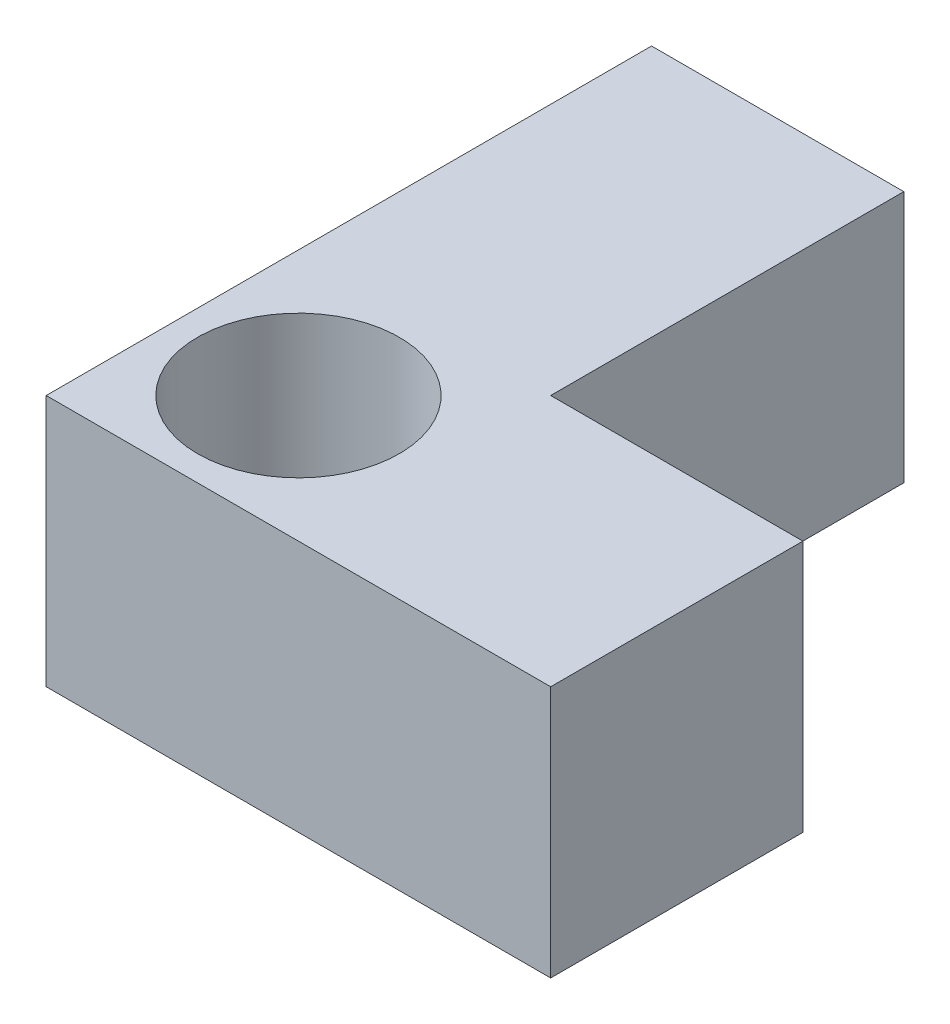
ISO-10303-21;
HEADER;
FILE_DESCRIPTION(('STEP AP214'),'2;1');
FILE_NAME('part.step','',(''),(''),'','','');
FILE_SCHEMA(('AUTOMOTIVE_DESIGN { 1 0 10303 214 1 1 1 1 }'));
ENDSEC;
DATA;
#1=APPLICATION_CONTEXT('core data for automotive mechanical design processes');
#2=APPLICATION_PROTOCOL_DEFINITION('international standard','automotive_design',2000,#1);
#3=PRODUCT_CONTEXT('',#1,'mechanical');
#4=PRODUCT('Part','Part','',(#3));
#5=PRODUCT_RELATED_PRODUCT_CATEGORY('part','',(#4));
#6=PRODUCT_DEFINITION_FORMATION('','',#4);
#7=PRODUCT_DEFINITION_CONTEXT('part definition',#1,'design');
#8=PRODUCT_DEFINITION('design','',#6,#7);
#9=PRODUCT_DEFINITION_SHAPE('','',#8);
#10=(LENGTH_UNIT() NAMED_UNIT(*) SI_UNIT(.MILLI.,.METRE.));
#11=(NAMED_UNIT(*) PLANE_ANGLE_UNIT() SI_UNIT($,.RADIAN.));
#12=(NAMED_UNIT(*) SI_UNIT($,.STERADIAN.) SOLID_ANGLE_UNIT());
#13=UNCERTAINTY_MEASURE_WITH_UNIT(LENGTH_MEASURE(1.E-05),#10,'distance_accuracy_value','');
#14=(GEOMETRIC_REPRESENTATION_CONTEXT(3) GLOBAL_UNCERTAINTY_ASSIGNED_CONTEXT((#13)) GLOBAL_UNIT_ASSIGNED_CONTEXT((#10,
#11,#12)) REPRESENTATION_CONTEXT('',''));
#15=CARTESIAN_POINT('',(0.,0.,0.));
#16=DIRECTION('',(0.,0.,1.));
#17=DIRECTION('',(1.,0.,0.));
#18=AXIS2_PLACEMENT_3D('',#15,#16,#17);
#19=CARTESIAN_POINT('',(100.,50.,0.));
#20=DIRECTION('',(0.,0.,-1.));
#21=DIRECTION('',(-1.,0.,0.));
#22=AXIS2_PLACEMENT_3D('',#19,#20,#21);
#23=PLANE('',#22);
#24=DIRECTION('',(1.,0.,0.));
#25=VECTOR('',#24,1.);
#26=CARTESIAN_POINT('',(100.,0.,0.));
#27=LINE('',#26,#25);
#28=CARTESIAN_POINT('',(0.,0.,0.));
#29=VERTEX_POINT('',#28);
#30=CARTESIAN_POINT('',(100.,0.,0.));
#31=VERTEX_POINT('',#30);
#32=EDGE_CURVE('E119',#29,#31,#27,.T.);
#33=ORIENTED_EDGE('',*,*,#32,.T.);
#34=DIRECTION('',(0.,-1.,0.));
#35=VECTOR('',#34,1.);
#36=CARTESIAN_POINT('',(100.,50.,0.));
#37=LINE('',#36,#35);
#38=CARTESIAN_POINT('',(100.,50.,0.));
#39=VERTEX_POINT('',#38);
#40=EDGE_CURVE('E11',#39,#31,#37,.T.);
#41=ORIENTED_EDGE('',*,*,#40,.F.);
#42=DIRECTION('',(1.,0.,0.));
#43=VECTOR('',#42,1.);
#44=CARTESIAN_POINT('',(100.,50.,0.));
#45=LINE('',#44,#43);
#46=CARTESIAN_POINT('',(0.,50.,0.));
#47=VERTEX_POINT('',#46);
#48=EDGE_CURVE('E130',#47,#39,#45,.T.);
#49=ORIENTED_EDGE('',*,*,#48,.F.);
#50=DIRECTION('',(0.,-1.,0.));
#51=VECTOR('',#50,1.);
#52=CARTESIAN_POINT('',(0.,50.,0.));
#53=LINE('',#52,#51);
#54=EDGE_CURVE('E115',#47,#29,#53,.T.);
#55=ORIENTED_EDGE('',*,*,#54,.T.);
#56=EDGE_LOOP('',(#33,#41,#49,#55));
#57=FACE_BOUND('',#56,.T.);
#58=ADVANCED_FACE('F35',(#57),#23,.F.);
#59=CARTESIAN_POINT('',(100.,50.,-50.));
#60=DIRECTION('',(-1.,0.,0.));
#61=DIRECTION('',(0.,0.,1.));
#62=AXIS2_PLACEMENT_3D('',#59,#60,#61);
#63=PLANE('',#62);
#64=DIRECTION('',(0.,0.,-1.));
#65=VECTOR('',#64,1.);
#66=CARTESIAN_POINT('',(100.,0.,-50.));
#67=LINE('',#66,#65);
#68=CARTESIAN_POINT('',(100.,0.,-50.));
#69=VERTEX_POINT('',#68);
#70=EDGE_CURVE('E122',#31,#69,#67,.T.);
#71=ORIENTED_EDGE('',*,*,#70,.T.);
#72=DIRECTION('',(0.,-1.,0.));
#73=VECTOR('',#72,1.);
#74=CARTESIAN_POINT('',(100.,50.,-50.));
#75=LINE('',#74,#73);
#76=CARTESIAN_POINT('',(100.,50.,-50.));
#77=VERTEX_POINT('',#76);
#78=EDGE_CURVE('E43',#77,#69,#75,.T.);
#79=ORIENTED_EDGE('',*,*,#78,.F.);
#80=DIRECTION('',(0.,0.,-1.));
#81=VECTOR('',#80,1.);
#82=CARTESIAN_POINT('',(100.,50.,-50.));
#83=LINE('',#82,#81);
#84=EDGE_CURVE('E88',#39,#77,#83,.T.);
#85=ORIENTED_EDGE('',*,*,#84,.F.);
#86=ORIENTED_EDGE('',*,*,#40,.T.);
#87=EDGE_LOOP('',(#71,#79,#85,#86));
#88=FACE_BOUND('',#87,.T.);
#89=ADVANCED_FACE('F155',(#88),#63,.F.);
#90=CARTESIAN_POINT('',(50.,50.,-50.));
#91=DIRECTION('',(0.,0.,1.));
#92=DIRECTION('',(1.,0.,0.));
#93=AXIS2_PLACEMENT_3D('',#90,#91,#92);
#94=PLANE('',#93);
#95=DIRECTION('',(-1.,0.,0.));
#96=VECTOR('',#95,1.);
#97=CARTESIAN_POINT('',(50.,0.,-50.));
#98=LINE('',#97,#96);
#99=CARTESIAN_POINT('',(50.,0.,-50.));
#100=VERTEX_POINT('',#99);
#101=EDGE_CURVE('E125',#69,#100,#98,.T.);
#102=ORIENTED_EDGE('',*,*,#101,.T.);
#103=DIRECTION('',(0.,-1.,0.));
#104=VECTOR('',#103,1.);
#105=CARTESIAN_POINT('',(50.,50.,-50.));
#106=LINE('',#105,#104);
#107=CARTESIAN_POINT('',(50.,50.,-50.));
#108=VERTEX_POINT('',#107);
#109=EDGE_CURVE('E110',#108,#100,#106,.T.);
#110=ORIENTED_EDGE('',*,*,#109,.F.);
#111=DIRECTION('',(-1.,0.,0.));
#112=VECTOR('',#111,1.);
#113=CARTESIAN_POINT('',(50.,50.,-50.));
#114=LINE('',#113,#112);
#115=EDGE_CURVE('E101',#77,#108,#114,.T.);
#116=ORIENTED_EDGE('',*,*,#115,.F.);
#117=ORIENTED_EDGE('',*,*,#78,.T.);
#118=EDGE_LOOP('',(#102,#110,#116,#117));
#119=FACE_BOUND('',#118,.T.);
#120=ADVANCED_FACE('F136',(#119),#94,.F.);
#121=CARTESIAN_POINT('',(50.,50.,-120.));
#122=DIRECTION('',(-1.,0.,0.));
#123=DIRECTION('',(0.,0.,1.));
#124=AXIS2_PLACEMENT_3D('',#121,#122,#123);
#125=PLANE('',#124);
#126=DIRECTION('',(0.,0.,-1.));
#127=VECTOR('',#126,1.);
#128=CARTESIAN_POINT('',(50.,0.,-120.));
#129=LINE('',#128,#127);
#130=CARTESIAN_POINT('',(50.,0.,-120.));
#131=VERTEX_POINT('',#130);
#132=EDGE_CURVE('E109',#100,#131,#129,.T.);
#133=ORIENTED_EDGE('',*,*,#132,.T.);
#134=DIRECTION('',(0.,-1.,0.));
#135=VECTOR('',#134,1.);
#136=CARTESIAN_POINT('',(50.,50.,-120.));
#137=LINE('',#136,#135);
#138=CARTESIAN_POINT('',(50.,50.,-120.));
#139=VERTEX_POINT('',#138);
#140=EDGE_CURVE('E106',#139,#131,#137,.T.);
#141=ORIENTED_EDGE('',*,*,#140,.F.);
#142=DIRECTION('',(0.,0.,-1.));
#143=VECTOR('',#142,1.);
#144=CARTESIAN_POINT('',(50.,50.,-120.));
#145=LINE('',#144,#143);
#146=EDGE_CURVE('E95',#108,#139,#145,.T.);
#147=ORIENTED_EDGE('',*,*,#146,.F.);
#148=ORIENTED_EDGE('',*,*,#109,.T.);
#149=EDGE_LOOP('',(#133,#141,#147,#148));
#150=FACE_BOUND('',#149,.T.);
#151=ADVANCED_FACE('F107',(#150),#125,.F.);
#152=CARTESIAN_POINT('',(0.,50.,-120.));
#153=DIRECTION('',(0.,0.,1.));
#154=DIRECTION('',(1.,0.,0.));
#155=AXIS2_PLACEMENT_3D('',#152,#153,#154);
#156=PLANE('',#155);
#157=DIRECTION('',(-1.,0.,0.));
#158=VECTOR('',#157,1.);
#159=CARTESIAN_POINT('',(0.,0.,-120.));
#160=LINE('',#159,#158);
#161=CARTESIAN_POINT('',(0.,0.,-120.));
#162=VERTEX_POINT('',#161);
#163=EDGE_CURVE('E74',#131,#162,#160,.T.);
#164=ORIENTED_EDGE('',*,*,#163,.T.);
#165=DIRECTION('',(0.,-1.,0.));
#166=VECTOR('',#165,1.);
#167=CARTESIAN_POINT('',(0.,50.,-120.));
#168=LINE('',#167,#166);
#169=CARTESIAN_POINT('',(0.,50.,-120.));
#170=VERTEX_POINT('',#169);
#171=EDGE_CURVE('E111',#170,#162,#168,.T.);
#172=ORIENTED_EDGE('',*,*,#171,.F.);
#173=DIRECTION('',(-1.,0.,0.));
#174=VECTOR('',#173,1.);
#175=CARTESIAN_POINT('',(0.,50.,-120.));
#176=LINE('',#175,#174);
#177=EDGE_CURVE('E99',#139,#170,#176,.T.);
#178=ORIENTED_EDGE('',*,*,#177,.F.);
#179=ORIENTED_EDGE('',*,*,#140,.T.);
#180=EDGE_LOOP('',(#164,#172,#178,#179));
#181=FACE_BOUND('',#180,.T.);
#182=ADVANCED_FACE('F113',(#181),#156,.F.);
#183=CARTESIAN_POINT('',(0.,50.,0.));
#184=DIRECTION('',(1.,0.,0.));
#185=DIRECTION('',(0.,0.,-1.));
#186=AXIS2_PLACEMENT_3D('',#183,#184,#185);
#187=PLANE('',#186);
#188=DIRECTION('',(0.,0.,1.));
#189=VECTOR('',#188,1.);
#190=CARTESIAN_POINT('',(0.,0.,0.));
#191=LINE('',#190,#189);
#192=EDGE_CURVE('E80',#162,#29,#191,.T.);
#193=ORIENTED_EDGE('',*,*,#192,.T.);
#194=ORIENTED_EDGE('',*,*,#54,.F.);
#195=DIRECTION('',(0.,0.,1.));
#196=VECTOR('',#195,1.);
#197=CARTESIAN_POINT('',(0.,50.,0.));
#198=LINE('',#197,#196);
#199=EDGE_CURVE('E51',#170,#47,#198,.T.);
#200=ORIENTED_EDGE('',*,*,#199,.F.);
#201=ORIENTED_EDGE('',*,*,#171,.T.);
#202=EDGE_LOOP('',(#193,#194,#200,#201));
#203=FACE_BOUND('',#202,.T.);
#204=ADVANCED_FACE('F143',(#203),#187,.F.);
#205=CARTESIAN_POINT('',(0.,50.,0.));
#206=DIRECTION('',(0.,-1.,0.));
#207=DIRECTION('',(0.,0.,-1.));
#208=AXIS2_PLACEMENT_3D('',#205,#206,#207);
#209=PLANE('',#208);
#210=CARTESIAN_POINT('',(25.,50.,-25.));
#211=DIRECTION('',(0.,1.,0.));
#212=DIRECTION('',(0.,0.,1.));
#213=AXIS2_PLACEMENT_3D('',#210,#211,#212);
#214=CIRCLE('',#213,20.);
#215=CARTESIAN_POINT('',(25.,50.,-5.00000000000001));
#216=VERTEX_POINT('',#215);
#217=EDGE_CURVE('E123',#216,#216,#214,.T.);
#218=ORIENTED_EDGE('',*,*,#217,.F.);
#219=EDGE_LOOP('',(#218));
#220=FACE_BOUND('',#219,.T.);
#221=ORIENTED_EDGE('',*,*,#48,.T.);
#222=ORIENTED_EDGE('',*,*,#84,.T.);
#223=ORIENTED_EDGE('',*,*,#115,.T.);
#224=ORIENTED_EDGE('',*,*,#146,.T.);
#225=ORIENTED_EDGE('',*,*,#177,.T.);
#226=ORIENTED_EDGE('',*,*,#199,.T.);
#227=EDGE_LOOP('',(#221,#222,#223,#224,#225,#226));
#228=FACE_BOUND('',#227,.T.);
#229=ADVANCED_FACE('F97',(#220,#228),#209,.F.);
#230=CARTESIAN_POINT('',(0.,0.,0.));
#231=DIRECTION('',(0.,-1.,0.));
#232=DIRECTION('',(0.,0.,-1.));
#233=AXIS2_PLACEMENT_3D('',#230,#231,#232);
#234=PLANE('',#233);
#235=CARTESIAN_POINT('',(25.,0.,-25.));
#236=DIRECTION('',(0.,1.,0.));
#237=DIRECTION('',(0.,0.,1.));
#238=AXIS2_PLACEMENT_3D('',#235,#236,#237);
#239=CIRCLE('',#238,20.);
#240=CARTESIAN_POINT('',(25.,0.,-5.00000000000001));
#241=VERTEX_POINT('',#240);
#242=EDGE_CURVE('E210',#241,#241,#239,.T.);
#243=ORIENTED_EDGE('',*,*,#242,.T.);
#244=EDGE_LOOP('',(#243));
#245=FACE_BOUND('',#244,.T.);
#246=ORIENTED_EDGE('',*,*,#32,.F.);
#247=ORIENTED_EDGE('',*,*,#192,.F.);
#248=ORIENTED_EDGE('',*,*,#163,.F.);
#249=ORIENTED_EDGE('',*,*,#132,.F.);
#250=ORIENTED_EDGE('',*,*,#101,.F.);
#251=ORIENTED_EDGE('',*,*,#70,.F.);
#252=EDGE_LOOP('',(#246,#247,#248,#249,#250,#251));
#253=FACE_BOUND('',#252,.T.);
#254=ADVANCED_FACE('F139',(#245,#253),#234,.T.);
#255=CARTESIAN_POINT('',(25.,50.,-25.));
#256=DIRECTION('',(0.,-1.,0.));
#257=DIRECTION('',(0.,0.,-1.));
#258=AXIS2_PLACEMENT_3D('',#255,#256,#257);
#259=CYLINDRICAL_SURFACE('',#258,20.);
#260=ORIENTED_EDGE('',*,*,#217,.T.);
#261=EDGE_LOOP('',(#260));
#262=FACE_BOUND('',#261,.T.);
#263=ORIENTED_EDGE('',*,*,#242,.F.);
#264=EDGE_LOOP('',(#263));
#265=FACE_BOUND('',#264,.T.);
#266=ADVANCED_FACE('F192',(#262,#265),#259,.F.);
#267=CLOSED_SHELL('',(#58,#89,#120,#151,#182,#204,#229,#254,#266));
#268=MANIFOLD_SOLID_BREP('B2',#267);
#269=ADVANCED_BREP_SHAPE_REPRESENTATION('',(#18,#268),#14);
#270=SHAPE_DEFINITION_REPRESENTATION(#9,#269);
ENDSEC;
END-ISO-10303-21;
